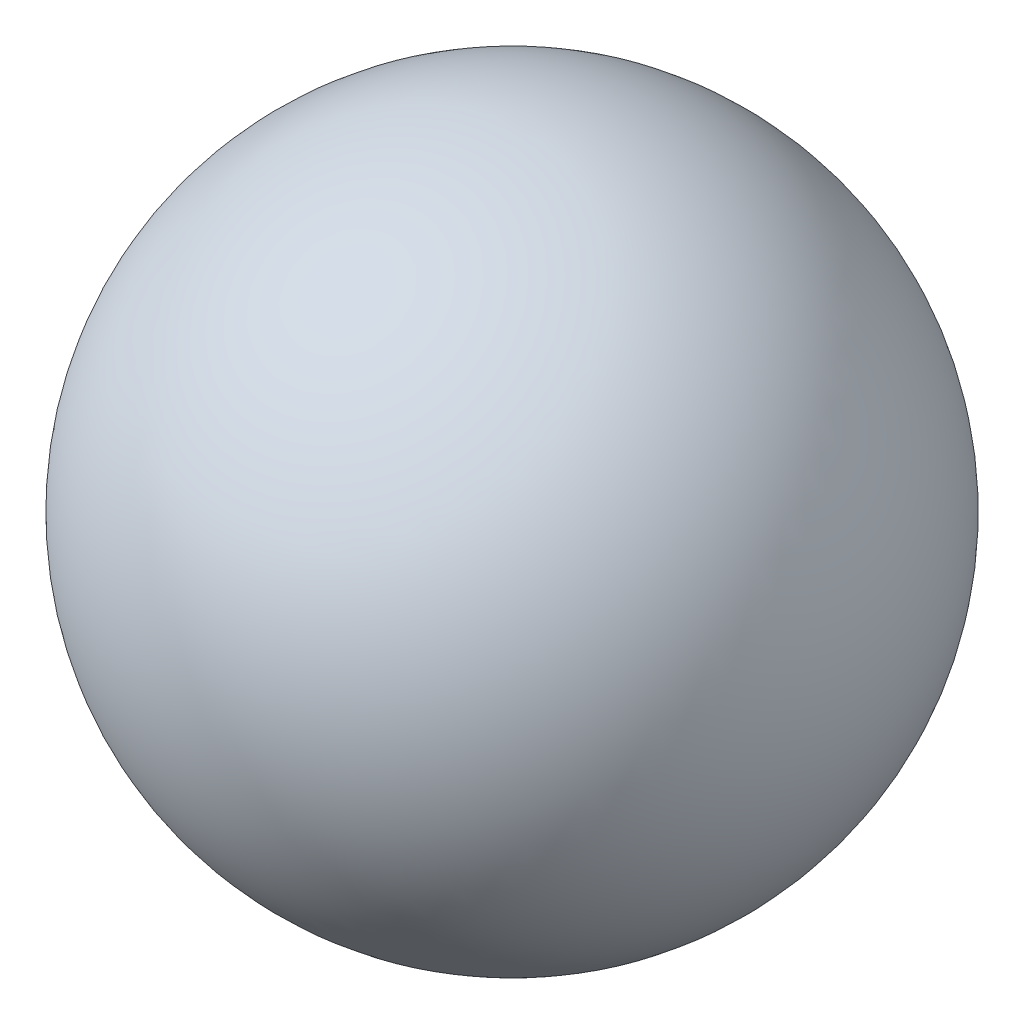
from build123d import *


with BuildPart() as part:
    # Sketch1 → Revolve1 (revolve)
    with BuildSketch(Plane.XY):
        with BuildLine():
            Line((0, 3.1242), (0, -3.1242))
            ThreePointArc((0, -3.1242), (3.1242, 0), (0, 3.1242))
        make_face()
    revolve(axis=Axis((0, 3.1242, 0), (0, -1, 0)))


solid = part.part
